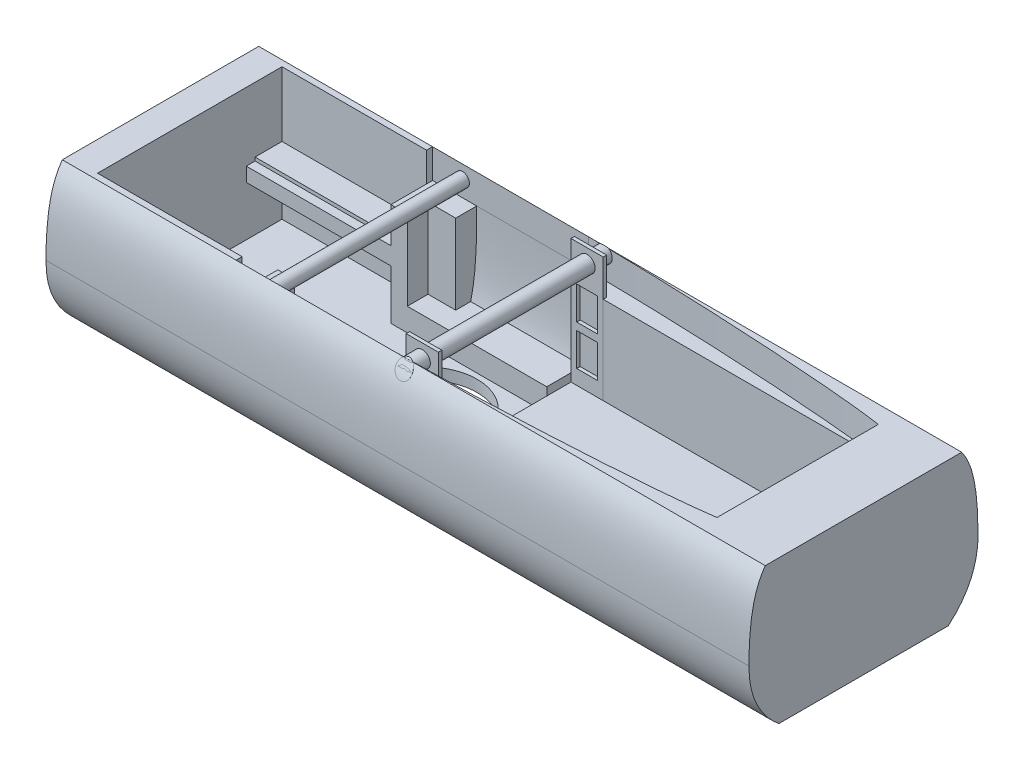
from build123d import *

# Parameters (mm, degrees)
BOSS_EXTRUDE1_DEPTH             = 13
BOSS_EXTRUDE2_DEPTH             = 20
BOSS_EXTRUDE2_2_DEPTH           = 20
BOSS_EXTRUDE3_DEPTH             = 89.2
BOSS_EXTRUDE4_DEPTH             = 10
CUT_EXTRUDE1_REACH              = 356.559
SKETCH7_W                       = 28
SKETCH7_H                       = 3
SKETCH8_W                       = 28
SKETCH8_H                       = 3
BOSS_EXTRUDE6_DEPTH             = 107.95
BOSS_EXTRUDE6_2_DEPTH           = 107.95
BOSS_EXTRUDE7_REACH             = 389.428
SKETCH9_R                       = 7
BOSS_EXTRUDE7_DIRECTION_2_REACH = 389.428
CUT_EXTRUDE2_DEPTH              = 2
CUT_EXTRUDE3_START              = -3
SKETCH12_W                      = 18
SKETCH12_H                      = 28.575
CUT_EXTRUDE3_DEPTH              = 146
BOSS_EXTRUDE10_DEPTH            = 124.599999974
SKETCH15_W                      = 31
SKETCH15_H                      = 15.24
BOSS_EXTRUDE11_DEPTH            = 125.4125
SKETCH16_W                      = 112.7125
SKETCH16_H                      = 113.24
CUT_EXTRUDE4_DEPTH              = 3
BOSS_EXTRUDE5_DEPTH             = 25.4
SKETCH20_R                      = 5.9436
BOSS_EXTRUDE12_DEPTH            = 170.479999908
SKETCH21_W                      = 22.86
SKETCH21_H                      = 17.78
CUT_EXTRUDE5_DEPTH              = 607.047978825
SKETCH22_OUTSIDE_W              = 343.64
SKETCH22_OUTSIDE_H              = 264.59
CUT_EXTRUDE6_DEPTH              = 631.580615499
CUT_EXTRUDE7_DEPTH              = 361.325010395
CUT_EXTRUDE7_DEPTH_BACK         = 361.325010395
SKETCH23_R                      = 44.45


with BuildPart() as part:
    # Sketch2 → Boss-Extrude1 (new body)
    with BuildSketch(Plane(origin=(0, 0, 0), x_dir=(1, 0, 0), z_dir=(0, 1, 0))):
        Polygon((266.7, 49), (266.7, -49), (266.7, -69.999999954), (0, -69.999999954), (0, -49), (0, 0), (0, 49), (0, 69.999999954), (266.7, 69.999999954), align=None)
    extrude(amount=BOSS_EXTRUDE1_DEPTH)



with BuildPart() as body_2:
    # Sketch3 → Boss-Extrude2 (new body)
    with BuildSketch(Plane(origin=(0, 0, 0), x_dir=(1, 0, 0), z_dir=(0, 1, 0))):
        Polygon((0, 49), (-121, 49), (-121, 67), (-97, 67), (-97, 80), (0, 80), (0, 68), align=None)
    extrude(amount=BOSS_EXTRUDE2_DEPTH)


with BuildPart() as body_3:
    # Sketch3 → Boss-Extrude2 2 (new body)
    with BuildSketch(Plane(origin=(0, 0, 0), x_dir=(1, 0, 0), z_dir=(0, 1, 0))):
        Polygon((0, -49), (-121, -49), (-121, -67), (-97, -67), (-97, -80), (0, -80), (0, -68), align=None)
    extrude(amount=BOSS_EXTRUDE2_2_DEPTH)


with BuildPart() as part_1:
    add(part.part)

    add(body_2.part)  # Boss-Extrude3 merges body 2

    add(body_3.part)  # Boss-Extrude3 merges body 3
    # Sketch4 → Boss-Extrude3 (add)
    with BuildSketch(Plane(origin=(0, 0, 0), x_dir=(1, 0, 0), z_dir=(0, 1, 0))):
        Polygon((-97, 80), (-97, 67), (-121, 67), (-121, 49), (-135.2875, 49), (-135.2875, 80), (-135.2875, 105), (323.8, 105), (323.8, -105), (-135.2875, -105), (-135.2875, -80), (-135.2875, -49), (-121, -49), (-121, -67), (-97, -67), (-97, -80), (0, -80), (0, -69.999999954), (266.7, -69.999999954), (266.7, 69.999999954), (0, 69.999999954), (0, 80), align=None)
    extrude(amount=BOSS_EXTRUDE3_DEPTH)

    # Sketch5 → Boss-Extrude4 (add)
    with BuildSketch(Plane(origin=(0, 0, 0), x_dir=(1, 0, 0), z_dir=(0, 1, 0))):
        Polygon((-260.7, 49), (-260.7, -49), (-260.7, -80), (-135.2875, -80), (-135.2875, -105), (323.8, -105), (323.8, 105), (-135.2875, 105), (-135.2875, 80), (-260.7, 80), align=None)
    extrude(amount=-BOSS_EXTRUDE4_DEPTH)

    # Cut-Extrude1: up to this face of the body (flat: up to its plane)
    cut_extrude1_end = Plane(part_1.part.faces().sort_by_distance((133.35, 13, 0))[0])
    # Sketch7 → Cut-Extrude1 (cut, up to the picked face)
    with BuildSketch(Plane(origin=(0, 89.2, 0), x_dir=(1, 0, 0), z_dir=(0, 1, 0)), mode=Mode.PRIVATE) as cut_extrude1_sk1:
        with Locations((14, 71.499999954)):
            Rectangle(SKETCH7_W, SKETCH7_H)
    cut_extrude1_tool1 = split(extrude(cut_extrude1_sk1.sketch, amount=-CUT_EXTRUDE1_REACH, mode=Mode.PRIVATE), bisect_by=cut_extrude1_end, keep=Keep.BOTH, mode=Mode.PRIVATE)
    # Sketch7 → Cut-Extrude1 (cut, up to the picked face)
    with BuildSketch(Plane(origin=(0, 89.2, 0), x_dir=(1, 0, 0), z_dir=(0, 1, 0)), mode=Mode.PRIVATE) as cut_extrude1_sk2:
        with Locations((14, -71.499999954)):
            Rectangle(SKETCH7_W, SKETCH7_H)
    cut_extrude1_tool2 = split(extrude(cut_extrude1_sk2.sketch, amount=-CUT_EXTRUDE1_REACH, mode=Mode.PRIVATE), bisect_by=cut_extrude1_end, keep=Keep.BOTH, mode=Mode.PRIVATE)
    add(cut_extrude1_tool1.solids().sort_by(Axis((14, 89.2, -71.5), (0, -1, 0)))[0], mode=Mode.SUBTRACT)
    add(cut_extrude1_tool2.solids().sort_by(Axis((14, 89.2, 71.5), (0, -1, 0)))[0], mode=Mode.SUBTRACT)


with BuildPart() as body_2_2:
    # Sketch8 → Boss-Extrude6 (new body)
    with BuildSketch(Plane(origin=(0, 13, 0), x_dir=(1, 0, 0), z_dir=(0, 1, 0))):
        with Locations((14, 71.499999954)):
            Rectangle(SKETCH8_W, SKETCH8_H)
    extrude(amount=BOSS_EXTRUDE6_DEPTH)


with BuildPart() as body_3_2:
    # Sketch8 → Boss-Extrude6 2 (new body)
    with BuildSketch(Plane(origin=(0, 13, 0), x_dir=(1, 0, 0), z_dir=(0, 1, 0))):
        with Locations((14, -71.499999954)):
            Rectangle(SKETCH8_W, SKETCH8_H)
    extrude(amount=BOSS_EXTRUDE6_2_DEPTH)


with BuildPart() as body_4:

    # Boss-Extrude7: up to this face of the body (flat: up to its plane)
    boss_extrude7_end = Plane(part_1.part.faces().sort_by_distance((94.25625, 39.6, 105))[0])
    # Sketch9 → Boss-Extrude7 (new, up to the picked face)
    with BuildSketch(Plane.XY.offset(-69.999999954), mode=Mode.PRIVATE) as boss_extrude7_sk1:
        with Locations(Location((14, 108.95, 0), (0, 0, 180))):
            Circle(SKETCH9_R)
    boss_extrude7_tool1 = split(extrude(boss_extrude7_sk1.sketch, amount=BOSS_EXTRUDE7_REACH, mode=Mode.PRIVATE), bisect_by=boss_extrude7_end, keep=Keep.BOTH, mode=Mode.PRIVATE)
    add(boss_extrude7_tool1.solids().sort_by(Axis((14, 108.95, -70), (0, 0, 1)))[0])


    # Boss-Extrude7 direction 2: up to this face of the body (flat: up to its plane)
    boss_extrude7_direction_2_end = Plane(part_1.part.faces().sort_by_distance((94.25625, 39.6, -105))[0])
    # Sketch9 → Boss-Extrude7 direction 2 (add, up to the picked face)
    with BuildSketch(Plane.XY.offset(-69.999999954), mode=Mode.PRIVATE) as boss_extrude7_direction_2_sk1:
        with Locations(Location((14, 108.95, 0), (0, 0, 180))):
            Circle(SKETCH9_R)
    boss_extrude7_direction_2_tool1 = split(extrude(boss_extrude7_direction_2_sk1.sketch, amount=-BOSS_EXTRUDE7_DIRECTION_2_REACH, mode=Mode.PRIVATE), bisect_by=boss_extrude7_direction_2_end, keep=Keep.BOTH, mode=Mode.PRIVATE)
    add(boss_extrude7_direction_2_tool1.solids().sort_by(Axis((14, 108.95, -70), (0, 0, -1)))[0])


with BuildPart() as part_2:
    add(part_1.part)

    # Sketch11 → Cut-Extrude2 (cut)
    with BuildSketch(Plane(origin=(0, 0, 0), x_dir=(1, 0, 0), z_dir=(0, 1, 0))):
        with BuildLine():
            Line((-88.9, 6.98), (-88.9, -6.98))
            ThreePointArc((-88.9, -6.98), (-55.88, -40), (-22.86, -6.98))
            Line((-22.86, -6.98), (-22.86, 6.98))
            ThreePointArc((-22.86, 6.98), (-55.88, 40), (-88.9, 6.98))
        make_face()
    extrude(amount=-CUT_EXTRUDE2_DEPTH, mode=Mode.SUBTRACT)

    # Sketch13 → Boss-Extrude10 (add)
    with BuildSketch(Plane(origin=(0, -10, 0), x_dir=(1, 0, 0), z_dir=(0, 1, 0))):
        Polygon((-135.2875, 105), (-286.1, 105), (-286.1, -105), (-135.2875, -105), (-135.2875, -80), (-260.7, -80), (-260.7, 80), (-135.2875, 80), align=None)
    extrude(amount=BOSS_EXTRUDE10_DEPTH)

    # Sketch15 → Boss-Extrude11 (add)
    with BuildSketch(Plane.ZY.offset(135.2875)):
        with Locations((-64.5, 50.8)):
            Rectangle(SKETCH15_W, SKETCH15_H)
        with Locations((64.5, 50.8)):
            Rectangle(SKETCH15_W, SKETCH15_H)
    extrude(amount=BOSS_EXTRUDE11_DEPTH)

    # Sketch16 → Cut-Extrude4 (cut)
    with BuildSketch(Plane(origin=(0, 58.42, 0), x_dir=(1, 0, 0), z_dir=(0, 1, 0))):
        with Locations((-204.34375, 0)):
            Rectangle(SKETCH16_W, SKETCH16_H)
    extrude(amount=-CUT_EXTRUDE4_DEPTH, mode=Mode.SUBTRACT)

    # Sketch19 → Cut-Loft1 section 0
    with BuildSketch(Plane(origin=(-97, 0, 0), x_dir=(0, 0, -1), z_dir=(1, 0, 0))):
        with BuildLine():
            Line((69.999999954, 20), (80, 20))
            add(Edge.make_bspline(
                [(80, 20), (85.485773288, 41.66683394), (85.26430299, 70.978994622), (85.239999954, 89.2)],
                knots=[0, 0, 0, 0, 1, 1, 1, 1], degree=3))
            Line((85.239999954, 89.2), (69.999999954, 89.2))
            Line((69.999999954, 89.2), (69.999999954, 20))
        make_face()
    # Sketch18 → Cut-Loft1 section 1
    with BuildSketch(Plane.ZY):
        with BuildLine():
            Line((-69.999999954, 89.2), (-85.239999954, 89.2))
            add(Edge.make_bspline(
                [(-80, 20), (-85.485773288, 41.66683394), (-85.26430299, 70.978994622), (-85.239999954, 89.2)],
                knots=[0, 0, 0, 0, 1, 1, 1, 1], degree=3))
            Line((-80, 20), (-69.999999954, 20))
            Line((-69.999999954, 20), (-69.999999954, 89.2))
        make_face()
    cut_loft1 = loft(mode=Mode.SUBTRACT)

    # Mirror1: Cut-Loft1 across plane
    add(cut_loft1.mirror(Plane.XY), mode=Mode.SUBTRACT)

    # Sketch6 → Boss-Extrude5 (add)
    with BuildSketch(Plane(origin=(0, 89.2, 0), x_dir=(1, 0, 0), z_dir=(0, 1, 0))):
        with BuildLine():
            Line((323.8, 105), (-135.2875, 105))
            Line((-135.2875, 105), (-135.2875, 85.239999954))
            Line((-135.2875, 85.239999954), (0, 85.239999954))
            add(Edge.make_bspline(
                [(0, 85.239999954), (130.862989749, 83.651218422), (236.677373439, 74.66679508), (266.7, 69.999999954)],
                knots=[0, 0, 0, 0, 1, 1, 1, 1], degree=3))
            Line((266.7, 69.999999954), (266.7, 0))
            Line((266.7, 0), (266.7, -69.999999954))
            add(Edge.make_bspline(
                [(0, -85.239999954), (130.862989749, -83.651218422), (236.677373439, -74.66679508), (266.7, -69.999999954)],
                knots=[0, 0, 0, 0, 1, 1, 1, 1], degree=3))
            Line((0, -85.239999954), (-135.2875, -85.239999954))
            Line((-135.2875, -85.239999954), (-135.2875, -105))
            Line((-135.2875, -105), (323.8, -105))
            Line((323.8, -105), (323.8, 105))
        make_face()
    extrude(amount=BOSS_EXTRUDE5_DEPTH)

    # Sketch21 → Cut-Extrude5 (cut, through all)
    with BuildSketch(Plane(origin=(-260.7, 0, 0), x_dir=(0, 0, -1), z_dir=(1, 0, 0))):
        with Locations((0, 8.89)):
            Rectangle(SKETCH21_W, SKETCH21_H)
    extrude(amount=-CUT_EXTRUDE5_DEPTH, mode=Mode.SUBTRACT)


with BuildPart() as cut_extrude3_tool:
    # Sketch12 → Cut-Extrude3 (new body)
    with BuildSketch(Plane.XY.offset(-69.999999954).offset(CUT_EXTRUDE3_START)):
        with Locations((14, 74.9125)):
            Rectangle(SKETCH12_W, SKETCH12_H)
        with Locations((14, 39.9875)):
            Rectangle(SKETCH12_W, SKETCH12_H)
    extrude(amount=CUT_EXTRUDE3_DEPTH)


with BuildPart() as body_2_2_1:
    add(body_2_2.part)

    # Cut-Extrude3: cut by cut_extrude3_tool
    add(cut_extrude3_tool.part, mode=Mode.SUBTRACT)


with BuildPart() as body_3_2_1:
    add(body_3_2.part)

    # Cut-Extrude3: cut by cut_extrude3_tool
    add(cut_extrude3_tool.part, mode=Mode.SUBTRACT)


with BuildPart() as body_5:
    # Sketch20 → Boss-Extrude12 (new body)
    with BuildSketch(Plane.XY.offset(-85.239999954)):
        with Locations((-109.2936, 103.0064)):
            Circle(SKETCH20_R)
    extrude(amount=BOSS_EXTRUDE12_DEPTH)


with BuildPart() as cut_extrude6_tool:
    # Sketch22 outside → Cut-Extrude6 (new, through all)
    with BuildSketch(Plane(origin=(323.8, 0, 0), x_dir=(0, 0, -1), z_dir=(1, 0, 0))):
        with Locations((0, 55.475)):
            Rectangle(SKETCH22_OUTSIDE_W, SKETCH22_OUTSIDE_H)
        with BuildLine():
            add(Edge.make_bspline(
                [(-99.346745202, 46.116217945), (-99.243767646, 124.753620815), (-77.258222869, 138.558497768), (0, 138.616217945)],
                knots=[0, 0, 0, 0, 1, 1, 1, 1], degree=3))
            add(Edge.make_bspline(
                [(99.346745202, 46.116217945), (99.243767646, 124.753620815), (77.258222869, 138.558497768), (0, 138.616217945)],
                knots=[0, 0, 0, 0, 1, 1, 1, 1], degree=3))
            add(Edge.make_bspline(
                [(99.346745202, 46.116217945), (100.010705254, -9.460460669), (45.558135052, -34.25811001), (0, -34.016217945)],
                knots=[0, 0, 0, 0, 1, 1, 1, 1], degree=3))
            add(Edge.make_bspline(
                [(-99.346745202, 46.116217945), (-100.010705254, -9.460460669), (-45.558135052, -34.25811001), (0, -34.016217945)],
                knots=[0, 0, 0, 0, 1, 1, 1, 1], degree=3))
        make_face(mode=Mode.SUBTRACT)
    extrude(amount=-CUT_EXTRUDE6_DEPTH)


with BuildPart() as part_3:
    add(part_2.part)

    # Cut-Extrude6: cut by cut_extrude6_tool
    add(cut_extrude6_tool.part, mode=Mode.SUBTRACT)

    # Sketch23 → Cut-Extrude7 (cut, two sides: drawn at the far end of the back side and taken through both)
    with BuildSketch(Plane(origin=(0, -2, 0), x_dir=(1, 0, 0), z_dir=(0, 1, 0)).offset(-CUT_EXTRUDE7_DEPTH_BACK)):
        with Locations(Location((-55.88, 0, 0), (0, 0, 270))):
            Circle(SKETCH23_R)
    extrude(amount=CUT_EXTRUDE7_DEPTH + CUT_EXTRUDE7_DEPTH_BACK, mode=Mode.SUBTRACT)


with BuildPart() as body_4_1:
    add(body_4.part)

    # Cut-Extrude6: cut by cut_extrude6_tool
    add(cut_extrude6_tool.part, mode=Mode.SUBTRACT)


solid = Compound([body_2_2_1.part, body_3_2_1.part, body_5.part, part_3.part, body_4_1.part])
